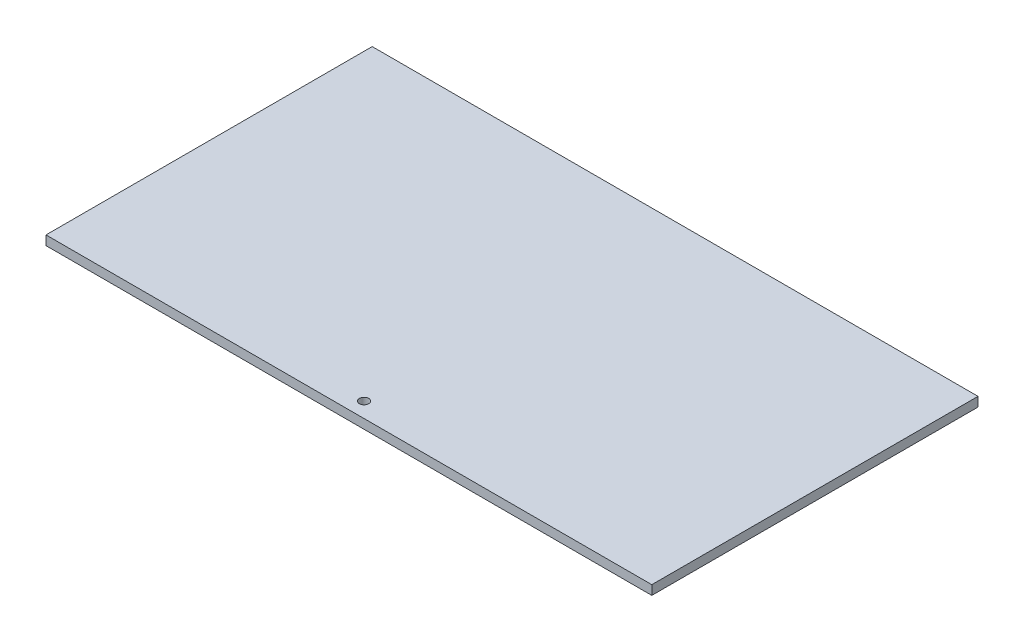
ISO-10303-21;
HEADER;
FILE_DESCRIPTION(('STEP AP214'),'2;1');
FILE_NAME('part.step','',(''),(''),'','','');
FILE_SCHEMA(('AUTOMOTIVE_DESIGN { 1 0 10303 214 1 1 1 1 }'));
ENDSEC;
DATA;
#1=APPLICATION_CONTEXT('core data for automotive mechanical design processes');
#2=APPLICATION_PROTOCOL_DEFINITION('international standard','automotive_design',2000,#1);
#3=PRODUCT_CONTEXT('',#1,'mechanical');
#4=PRODUCT('Part','Part','',(#3));
#5=PRODUCT_RELATED_PRODUCT_CATEGORY('part','',(#4));
#6=PRODUCT_DEFINITION_FORMATION('','',#4);
#7=PRODUCT_DEFINITION_CONTEXT('part definition',#1,'design');
#8=PRODUCT_DEFINITION('design','',#6,#7);
#9=PRODUCT_DEFINITION_SHAPE('','',#8);
#10=(LENGTH_UNIT() NAMED_UNIT(*) SI_UNIT(.MILLI.,.METRE.));
#11=(NAMED_UNIT(*) PLANE_ANGLE_UNIT() SI_UNIT($,.RADIAN.));
#12=(NAMED_UNIT(*) SI_UNIT($,.STERADIAN.) SOLID_ANGLE_UNIT());
#13=UNCERTAINTY_MEASURE_WITH_UNIT(LENGTH_MEASURE(1.E-05),#10,'distance_accuracy_value','');
#14=(GEOMETRIC_REPRESENTATION_CONTEXT(3) GLOBAL_UNCERTAINTY_ASSIGNED_CONTEXT((#13)) GLOBAL_UNIT_ASSIGNED_CONTEXT((#10,
#11,#12)) REPRESENTATION_CONTEXT('',''));
#15=CARTESIAN_POINT('',(0.,0.,0.));
#16=DIRECTION('',(0.,0.,1.));
#17=DIRECTION('',(1.,0.,0.));
#18=AXIS2_PLACEMENT_3D('',#15,#16,#17);
#19=CARTESIAN_POINT('',(65.,2.,-35.));
#20=DIRECTION('',(-1.,0.,0.));
#21=DIRECTION('',(0.,0.,1.));
#22=AXIS2_PLACEMENT_3D('',#19,#20,#21);
#23=PLANE('',#22);
#24=DIRECTION('',(0.,0.,-1.));
#25=VECTOR('',#24,1.);
#26=CARTESIAN_POINT('',(65.,0.,-35.));
#27=LINE('',#26,#25);
#28=CARTESIAN_POINT('',(65.,0.,35.));
#29=VERTEX_POINT('',#28);
#30=CARTESIAN_POINT('',(65.,0.,-35.));
#31=VERTEX_POINT('',#30);
#32=EDGE_CURVE('E96',#29,#31,#27,.T.);
#33=ORIENTED_EDGE('',*,*,#32,.T.);
#34=DIRECTION('',(0.,-1.,0.));
#35=VECTOR('',#34,1.);
#36=CARTESIAN_POINT('',(65.,2.,-35.));
#37=LINE('',#36,#35);
#38=CARTESIAN_POINT('',(65.,2.,-35.));
#39=VERTEX_POINT('',#38);
#40=EDGE_CURVE('E11',#39,#31,#37,.T.);
#41=ORIENTED_EDGE('',*,*,#40,.F.);
#42=DIRECTION('',(0.,0.,-1.));
#43=VECTOR('',#42,1.);
#44=CARTESIAN_POINT('',(65.,2.,-35.));
#45=LINE('',#44,#43);
#46=CARTESIAN_POINT('',(65.,2.,35.));
#47=VERTEX_POINT('',#46);
#48=EDGE_CURVE('E84',#47,#39,#45,.T.);
#49=ORIENTED_EDGE('',*,*,#48,.F.);
#50=DIRECTION('',(0.,-1.,0.));
#51=VECTOR('',#50,1.);
#52=CARTESIAN_POINT('',(65.,2.,35.));
#53=LINE('',#52,#51);
#54=EDGE_CURVE('E92',#47,#29,#53,.T.);
#55=ORIENTED_EDGE('',*,*,#54,.T.);
#56=EDGE_LOOP('',(#33,#41,#49,#55));
#57=FACE_BOUND('',#56,.T.);
#58=ADVANCED_FACE('F33',(#57),#23,.F.);
#59=CARTESIAN_POINT('',(-65.,2.,-35.));
#60=DIRECTION('',(0.,0.,1.));
#61=DIRECTION('',(1.,0.,0.));
#62=AXIS2_PLACEMENT_3D('',#59,#60,#61);
#63=PLANE('',#62);
#64=DIRECTION('',(-1.,0.,0.));
#65=VECTOR('',#64,1.);
#66=CARTESIAN_POINT('',(-65.,0.,-35.));
#67=LINE('',#66,#65);
#68=CARTESIAN_POINT('',(-65.,0.,-35.));
#69=VERTEX_POINT('',#68);
#70=EDGE_CURVE('E88',#31,#69,#67,.T.);
#71=ORIENTED_EDGE('',*,*,#70,.T.);
#72=DIRECTION('',(0.,-1.,0.));
#73=VECTOR('',#72,1.);
#74=CARTESIAN_POINT('',(-65.,2.,-35.));
#75=LINE('',#74,#73);
#76=CARTESIAN_POINT('',(-65.,2.,-35.));
#77=VERTEX_POINT('',#76);
#78=EDGE_CURVE('E41',#77,#69,#75,.T.);
#79=ORIENTED_EDGE('',*,*,#78,.F.);
#80=DIRECTION('',(-1.,0.,0.));
#81=VECTOR('',#80,1.);
#82=CARTESIAN_POINT('',(-65.,2.,-35.));
#83=LINE('',#82,#81);
#84=EDGE_CURVE('E79',#39,#77,#83,.T.);
#85=ORIENTED_EDGE('',*,*,#84,.F.);
#86=ORIENTED_EDGE('',*,*,#40,.T.);
#87=EDGE_LOOP('',(#71,#79,#85,#86));
#88=FACE_BOUND('',#87,.T.);
#89=ADVANCED_FACE('F87',(#88),#63,.F.);
#90=CARTESIAN_POINT('',(-65.,2.,-35.));
#91=DIRECTION('',(1.,0.,0.));
#92=DIRECTION('',(0.,0.,-1.));
#93=AXIS2_PLACEMENT_3D('',#90,#91,#92);
#94=PLANE('',#93);
#95=DIRECTION('',(0.,0.,1.));
#96=VECTOR('',#95,1.);
#97=CARTESIAN_POINT('',(-65.,0.,-35.));
#98=LINE('',#97,#96);
#99=CARTESIAN_POINT('',(-65.,0.,35.));
#100=VERTEX_POINT('',#99);
#101=EDGE_CURVE('E66',#69,#100,#98,.T.);
#102=ORIENTED_EDGE('',*,*,#101,.T.);
#103=DIRECTION('',(0.,-1.,0.));
#104=VECTOR('',#103,1.);
#105=CARTESIAN_POINT('',(-65.,2.,35.));
#106=LINE('',#105,#104);
#107=CARTESIAN_POINT('',(-65.,2.,35.));
#108=VERTEX_POINT('',#107);
#109=EDGE_CURVE('E89',#108,#100,#106,.T.);
#110=ORIENTED_EDGE('',*,*,#109,.F.);
#111=DIRECTION('',(0.,0.,1.));
#112=VECTOR('',#111,1.);
#113=CARTESIAN_POINT('',(-65.,2.,-35.));
#114=LINE('',#113,#112);
#115=EDGE_CURVE('E82',#77,#108,#114,.T.);
#116=ORIENTED_EDGE('',*,*,#115,.F.);
#117=ORIENTED_EDGE('',*,*,#78,.T.);
#118=EDGE_LOOP('',(#102,#110,#116,#117));
#119=FACE_BOUND('',#118,.T.);
#120=ADVANCED_FACE('F90',(#119),#94,.F.);
#121=CARTESIAN_POINT('',(-65.,2.,35.));
#122=DIRECTION('',(0.,0.,-1.));
#123=DIRECTION('',(-1.,0.,0.));
#124=AXIS2_PLACEMENT_3D('',#121,#122,#123);
#125=PLANE('',#124);
#126=DIRECTION('',(1.,0.,0.));
#127=VECTOR('',#126,1.);
#128=CARTESIAN_POINT('',(-65.,0.,35.));
#129=LINE('',#128,#127);
#130=EDGE_CURVE('E72',#100,#29,#129,.T.);
#131=ORIENTED_EDGE('',*,*,#130,.T.);
#132=ORIENTED_EDGE('',*,*,#54,.F.);
#133=DIRECTION('',(1.,0.,0.));
#134=VECTOR('',#133,1.);
#135=CARTESIAN_POINT('',(-65.,2.,35.));
#136=LINE('',#135,#134);
#137=EDGE_CURVE('E49',#108,#47,#136,.T.);
#138=ORIENTED_EDGE('',*,*,#137,.F.);
#139=ORIENTED_EDGE('',*,*,#109,.T.);
#140=EDGE_LOOP('',(#131,#132,#138,#139));
#141=FACE_BOUND('',#140,.T.);
#142=ADVANCED_FACE('F104',(#141),#125,.F.);
#143=CARTESIAN_POINT('',(0.,2.,0.));
#144=DIRECTION('',(0.,1.,0.));
#145=DIRECTION('',(0.,0.,1.));
#146=AXIS2_PLACEMENT_3D('',#143,#144,#145);
#147=PLANE('',#146);
#148=CARTESIAN_POINT('',(0.,2.,31.7530699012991));
#149=DIRECTION('',(0.,1.,0.));
#150=DIRECTION('',(0.,0.,1.));
#151=AXIS2_PLACEMENT_3D('',#148,#149,#150);
#152=CIRCLE('',#151,1.);
#153=CARTESIAN_POINT('',(0.,2.,32.7530699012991));
#154=VERTEX_POINT('',#153);
#155=EDGE_CURVE('E110',#154,#154,#152,.T.);
#156=ORIENTED_EDGE('',*,*,#155,.F.);
#157=EDGE_LOOP('',(#156));
#158=FACE_BOUND('',#157,.T.);
#159=ORIENTED_EDGE('',*,*,#48,.T.);
#160=ORIENTED_EDGE('',*,*,#84,.T.);
#161=ORIENTED_EDGE('',*,*,#115,.T.);
#162=ORIENTED_EDGE('',*,*,#137,.T.);
#163=EDGE_LOOP('',(#159,#160,#161,#162));
#164=FACE_BOUND('',#163,.T.);
#165=ADVANCED_FACE('F80',(#158,#164),#147,.T.);
#166=CARTESIAN_POINT('',(0.,0.,0.));
#167=DIRECTION('',(0.,1.,0.));
#168=DIRECTION('',(0.,0.,1.));
#169=AXIS2_PLACEMENT_3D('',#166,#167,#168);
#170=PLANE('',#169);
#171=CARTESIAN_POINT('',(0.,0.,31.7530699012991));
#172=DIRECTION('',(0.,1.,0.));
#173=DIRECTION('',(0.,0.,1.));
#174=AXIS2_PLACEMENT_3D('',#171,#172,#173);
#175=CIRCLE('',#174,1.);
#176=CARTESIAN_POINT('',(0.,0.,32.7530699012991));
#177=VERTEX_POINT('',#176);
#178=EDGE_CURVE('E99',#177,#177,#175,.T.);
#179=ORIENTED_EDGE('',*,*,#178,.T.);
#180=EDGE_LOOP('',(#179));
#181=FACE_BOUND('',#180,.T.);
#182=ORIENTED_EDGE('',*,*,#32,.F.);
#183=ORIENTED_EDGE('',*,*,#130,.F.);
#184=ORIENTED_EDGE('',*,*,#101,.F.);
#185=ORIENTED_EDGE('',*,*,#70,.F.);
#186=EDGE_LOOP('',(#182,#183,#184,#185));
#187=FACE_BOUND('',#186,.T.);
#188=ADVANCED_FACE('F107',(#181,#187),#170,.F.);
#189=CARTESIAN_POINT('',(0.,0.,31.7530699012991));
#190=DIRECTION('',(0.,1.,0.));
#191=DIRECTION('',(0.,0.,1.));
#192=AXIS2_PLACEMENT_3D('',#189,#190,#191);
#193=CYLINDRICAL_SURFACE('',#192,1.);
#194=ORIENTED_EDGE('',*,*,#178,.F.);
#195=EDGE_LOOP('',(#194));
#196=FACE_BOUND('',#195,.T.);
#197=ORIENTED_EDGE('',*,*,#155,.T.);
#198=EDGE_LOOP('',(#197));
#199=FACE_BOUND('',#198,.T.);
#200=ADVANCED_FACE('F117',(#196,#199),#193,.F.);
#201=CLOSED_SHELL('',(#58,#89,#120,#142,#165,#188,#200));
#202=MANIFOLD_SOLID_BREP('B2',#201);
#203=ADVANCED_BREP_SHAPE_REPRESENTATION('',(#18,#202),#14);
#204=SHAPE_DEFINITION_REPRESENTATION(#9,#203);
ENDSEC;
END-ISO-10303-21;
